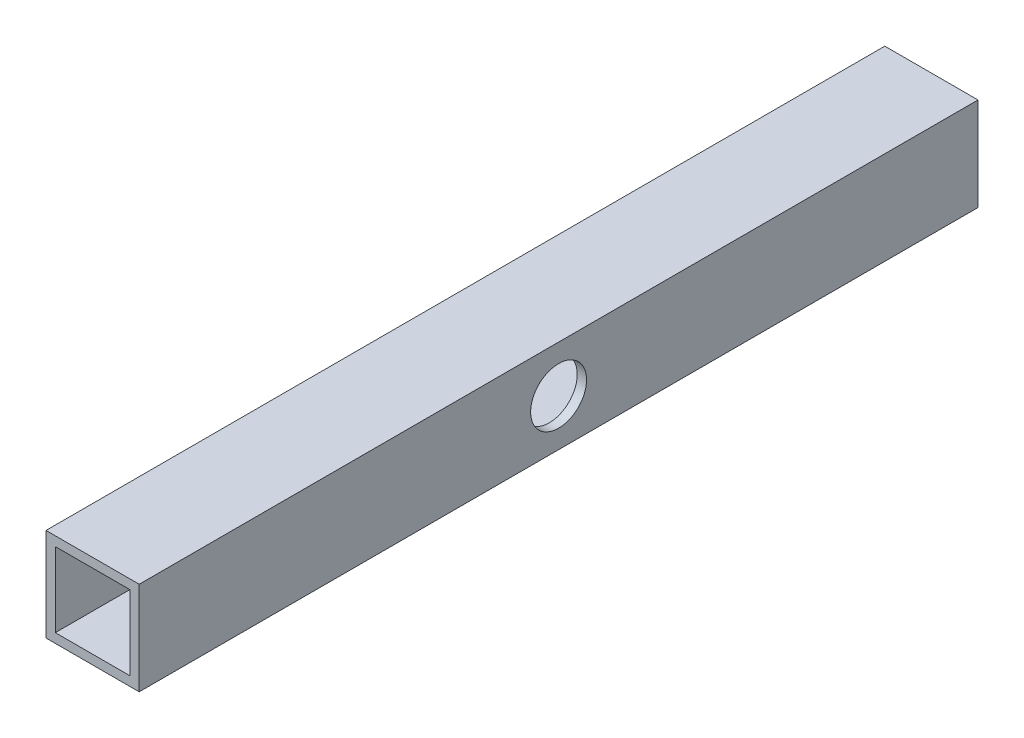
ISO-10303-21;
HEADER;
FILE_DESCRIPTION(('STEP AP214'),'2;1');
FILE_NAME('part.step','',(''),(''),'','','');
FILE_SCHEMA(('AUTOMOTIVE_DESIGN { 1 0 10303 214 1 1 1 1 }'));
ENDSEC;
DATA;
#1=APPLICATION_CONTEXT('core data for automotive mechanical design processes');
#2=APPLICATION_PROTOCOL_DEFINITION('international standard','automotive_design',2000,#1);
#3=PRODUCT_CONTEXT('',#1,'mechanical');
#4=PRODUCT('Part','Part','',(#3));
#5=PRODUCT_RELATED_PRODUCT_CATEGORY('part','',(#4));
#6=PRODUCT_DEFINITION_FORMATION('','',#4);
#7=PRODUCT_DEFINITION_CONTEXT('part definition',#1,'design');
#8=PRODUCT_DEFINITION('design','',#6,#7);
#9=PRODUCT_DEFINITION_SHAPE('','',#8);
#10=(LENGTH_UNIT() NAMED_UNIT(*) SI_UNIT(.MILLI.,.METRE.));
#11=(NAMED_UNIT(*) PLANE_ANGLE_UNIT() SI_UNIT($,.RADIAN.));
#12=(NAMED_UNIT(*) SI_UNIT($,.STERADIAN.) SOLID_ANGLE_UNIT());
#13=UNCERTAINTY_MEASURE_WITH_UNIT(LENGTH_MEASURE(1.E-05),#10,'distance_accuracy_value','');
#14=(GEOMETRIC_REPRESENTATION_CONTEXT(3) GLOBAL_UNCERTAINTY_ASSIGNED_CONTEXT((#13)) GLOBAL_UNIT_ASSIGNED_CONTEXT((#10,
#11,#12)) REPRESENTATION_CONTEXT('',''));
#15=CARTESIAN_POINT('',(0.,0.,0.));
#16=DIRECTION('',(0.,0.,1.));
#17=DIRECTION('',(1.,0.,0.));
#18=AXIS2_PLACEMENT_3D('',#15,#16,#17);
#19=CARTESIAN_POINT('',(0.,0.,450.));
#20=DIRECTION('',(0.,0.,1.));
#21=DIRECTION('',(1.,0.,0.));
#22=AXIS2_PLACEMENT_3D('',#19,#20,#21);
#23=PLANE('',#22);
#24=DIRECTION('',(0.,1.,0.));
#25=VECTOR('',#24,1.);
#26=CARTESIAN_POINT('',(0.,0.,450.));
#27=LINE('',#26,#25);
#28=CARTESIAN_POINT('',(0.,0.,450.));
#29=VERTEX_POINT('',#28);
#30=CARTESIAN_POINT('',(0.,50.,450.));
#31=VERTEX_POINT('',#30);
#32=EDGE_CURVE('E139',#29,#31,#27,.T.);
#33=ORIENTED_EDGE('',*,*,#32,.T.);
#34=DIRECTION('',(-1.,0.,0.));
#35=VECTOR('',#34,1.);
#36=CARTESIAN_POINT('',(0.,50.,450.));
#37=LINE('',#36,#35);
#38=CARTESIAN_POINT('',(-50.,50.,450.));
#39=VERTEX_POINT('',#38);
#40=EDGE_CURVE('E142',#31,#39,#37,.T.);
#41=ORIENTED_EDGE('',*,*,#40,.T.);
#42=DIRECTION('',(0.,-1.,0.));
#43=VECTOR('',#42,1.);
#44=CARTESIAN_POINT('',(-50.,0.,450.));
#45=LINE('',#44,#43);
#46=CARTESIAN_POINT('',(-50.,0.,450.));
#47=VERTEX_POINT('',#46);
#48=EDGE_CURVE('E145',#39,#47,#45,.T.);
#49=ORIENTED_EDGE('',*,*,#48,.T.);
#50=DIRECTION('',(1.,0.,0.));
#51=VECTOR('',#50,1.);
#52=CARTESIAN_POINT('',(0.,0.,450.));
#53=LINE('',#52,#51);
#54=EDGE_CURVE('E147',#47,#29,#53,.T.);
#55=ORIENTED_EDGE('',*,*,#54,.T.);
#56=EDGE_LOOP('',(#33,#41,#49,#55));
#57=FACE_BOUND('',#56,.T.);
#58=DIRECTION('',(-1.,0.,0.));
#59=VECTOR('',#58,1.);
#60=CARTESIAN_POINT('',(-5.,45.,450.));
#61=LINE('',#60,#59);
#62=CARTESIAN_POINT('',(-5.,45.,450.));
#63=VERTEX_POINT('',#62);
#64=CARTESIAN_POINT('',(-45.,45.,450.));
#65=VERTEX_POINT('',#64);
#66=EDGE_CURVE('E109',#63,#65,#61,.T.);
#67=ORIENTED_EDGE('',*,*,#66,.F.);
#68=DIRECTION('',(0.,1.,0.));
#69=VECTOR('',#68,1.);
#70=CARTESIAN_POINT('',(-5.,5.,450.));
#71=LINE('',#70,#69);
#72=CARTESIAN_POINT('',(-5.,5.,450.));
#73=VERTEX_POINT('',#72);
#74=EDGE_CURVE('E101',#73,#63,#71,.T.);
#75=ORIENTED_EDGE('',*,*,#74,.F.);
#76=DIRECTION('',(1.,0.,0.));
#77=VECTOR('',#76,1.);
#78=CARTESIAN_POINT('',(-5.,5.,450.));
#79=LINE('',#78,#77);
#80=CARTESIAN_POINT('',(-45.,5.,450.));
#81=VERTEX_POINT('',#80);
#82=EDGE_CURVE('E123',#81,#73,#79,.T.);
#83=ORIENTED_EDGE('',*,*,#82,.F.);
#84=DIRECTION('',(0.,-1.,0.));
#85=VECTOR('',#84,1.);
#86=CARTESIAN_POINT('',(-45.,5.,450.));
#87=LINE('',#86,#85);
#88=EDGE_CURVE('E121',#65,#81,#87,.T.);
#89=ORIENTED_EDGE('',*,*,#88,.F.);
#90=EDGE_LOOP('',(#67,#75,#83,#89));
#91=FACE_BOUND('',#90,.T.);
#92=ADVANCED_FACE('F35',(#57,#91),#23,.T.);
#93=CARTESIAN_POINT('',(0.,0.,0.));
#94=DIRECTION('',(0.,0.,1.));
#95=DIRECTION('',(1.,0.,0.));
#96=AXIS2_PLACEMENT_3D('',#93,#94,#95);
#97=PLANE('',#96);
#98=DIRECTION('',(0.,1.,0.));
#99=VECTOR('',#98,1.);
#100=CARTESIAN_POINT('',(0.,0.,0.));
#101=LINE('',#100,#99);
#102=CARTESIAN_POINT('',(0.,0.,0.));
#103=VERTEX_POINT('',#102);
#104=CARTESIAN_POINT('',(0.,50.,0.));
#105=VERTEX_POINT('',#104);
#106=EDGE_CURVE('E117',#103,#105,#101,.T.);
#107=ORIENTED_EDGE('',*,*,#106,.F.);
#108=DIRECTION('',(1.,0.,0.));
#109=VECTOR('',#108,1.);
#110=CARTESIAN_POINT('',(0.,0.,0.));
#111=LINE('',#110,#109);
#112=CARTESIAN_POINT('',(-50.,0.,0.));
#113=VERTEX_POINT('',#112);
#114=EDGE_CURVE('E143',#113,#103,#111,.T.);
#115=ORIENTED_EDGE('',*,*,#114,.F.);
#116=DIRECTION('',(0.,-1.,0.));
#117=VECTOR('',#116,1.);
#118=CARTESIAN_POINT('',(-50.,0.,0.));
#119=LINE('',#118,#117);
#120=CARTESIAN_POINT('',(-50.,50.,0.));
#121=VERTEX_POINT('',#120);
#122=EDGE_CURVE('E154',#121,#113,#119,.T.);
#123=ORIENTED_EDGE('',*,*,#122,.F.);
#124=DIRECTION('',(-1.,0.,0.));
#125=VECTOR('',#124,1.);
#126=CARTESIAN_POINT('',(0.,50.,0.));
#127=LINE('',#126,#125);
#128=EDGE_CURVE('E152',#105,#121,#127,.T.);
#129=ORIENTED_EDGE('',*,*,#128,.F.);
#130=EDGE_LOOP('',(#107,#115,#123,#129));
#131=FACE_BOUND('',#130,.T.);
#132=DIRECTION('',(0.,1.,0.));
#133=VECTOR('',#132,1.);
#134=CARTESIAN_POINT('',(-5.,5.,0.));
#135=LINE('',#134,#133);
#136=CARTESIAN_POINT('',(-5.,5.,0.));
#137=VERTEX_POINT('',#136);
#138=CARTESIAN_POINT('',(-5.,45.,0.));
#139=VERTEX_POINT('',#138);
#140=EDGE_CURVE('E59',#137,#139,#135,.T.);
#141=ORIENTED_EDGE('',*,*,#140,.T.);
#142=DIRECTION('',(-1.,0.,0.));
#143=VECTOR('',#142,1.);
#144=CARTESIAN_POINT('',(-5.,45.,0.));
#145=LINE('',#144,#143);
#146=CARTESIAN_POINT('',(-45.,45.,0.));
#147=VERTEX_POINT('',#146);
#148=EDGE_CURVE('E116',#139,#147,#145,.T.);
#149=ORIENTED_EDGE('',*,*,#148,.T.);
#150=DIRECTION('',(0.,-1.,0.));
#151=VECTOR('',#150,1.);
#152=CARTESIAN_POINT('',(-45.,5.,0.));
#153=LINE('',#152,#151);
#154=CARTESIAN_POINT('',(-45.,5.,0.));
#155=VERTEX_POINT('',#154);
#156=EDGE_CURVE('E131',#147,#155,#153,.T.);
#157=ORIENTED_EDGE('',*,*,#156,.T.);
#158=DIRECTION('',(1.,0.,0.));
#159=VECTOR('',#158,1.);
#160=CARTESIAN_POINT('',(-5.,5.,0.));
#161=LINE('',#160,#159);
#162=EDGE_CURVE('E110',#155,#137,#161,.T.);
#163=ORIENTED_EDGE('',*,*,#162,.T.);
#164=EDGE_LOOP('',(#141,#149,#157,#163));
#165=FACE_BOUND('',#164,.T.);
#166=ADVANCED_FACE('F173',(#131,#165),#97,.F.);
#167=CARTESIAN_POINT('',(0.,0.,450.));
#168=DIRECTION('',(-1.,0.,0.));
#169=DIRECTION('',(0.,0.,1.));
#170=AXIS2_PLACEMENT_3D('',#167,#168,#169);
#171=PLANE('',#170);
#172=CARTESIAN_POINT('',(0.,25.,225.));
#173=DIRECTION('',(1.,0.,0.));
#174=DIRECTION('',(0.,0.,-1.));
#175=AXIS2_PLACEMENT_3D('',#172,#173,#174);
#176=CIRCLE('',#175,15.);
#177=CARTESIAN_POINT('',(0.,25.,210.));
#178=VERTEX_POINT('',#177);
#179=EDGE_CURVE('E217',#178,#178,#176,.T.);
#180=ORIENTED_EDGE('',*,*,#179,.F.);
#181=EDGE_LOOP('',(#180));
#182=FACE_BOUND('',#181,.T.);
#183=ORIENTED_EDGE('',*,*,#106,.T.);
#184=DIRECTION('',(0.,0.,-1.));
#185=VECTOR('',#184,1.);
#186=CARTESIAN_POINT('',(0.,50.,450.));
#187=LINE('',#186,#185);
#188=EDGE_CURVE('E11',#31,#105,#187,.T.);
#189=ORIENTED_EDGE('',*,*,#188,.F.);
#190=ORIENTED_EDGE('',*,*,#32,.F.);
#191=DIRECTION('',(0.,0.,-1.));
#192=VECTOR('',#191,1.);
#193=CARTESIAN_POINT('',(0.,0.,450.));
#194=LINE('',#193,#192);
#195=EDGE_CURVE('E149',#29,#103,#194,.T.);
#196=ORIENTED_EDGE('',*,*,#195,.T.);
#197=EDGE_LOOP('',(#183,#189,#190,#196));
#198=FACE_BOUND('',#197,.T.);
#199=ADVANCED_FACE('F37',(#182,#198),#171,.F.);
#200=CARTESIAN_POINT('',(0.,50.,450.));
#201=DIRECTION('',(0.,-1.,0.));
#202=DIRECTION('',(1.,0.,0.));
#203=AXIS2_PLACEMENT_3D('',#200,#201,#202);
#204=PLANE('',#203);
#205=ORIENTED_EDGE('',*,*,#128,.T.);
#206=DIRECTION('',(0.,0.,-1.));
#207=VECTOR('',#206,1.);
#208=CARTESIAN_POINT('',(-50.,50.,450.));
#209=LINE('',#208,#207);
#210=EDGE_CURVE('E44',#39,#121,#209,.T.);
#211=ORIENTED_EDGE('',*,*,#210,.F.);
#212=ORIENTED_EDGE('',*,*,#40,.F.);
#213=ORIENTED_EDGE('',*,*,#188,.T.);
#214=EDGE_LOOP('',(#205,#211,#212,#213));
#215=FACE_BOUND('',#214,.T.);
#216=ADVANCED_FACE('F183',(#215),#204,.F.);
#217=CARTESIAN_POINT('',(-50.,0.,450.));
#218=DIRECTION('',(1.,0.,0.));
#219=DIRECTION('',(0.,0.,-1.));
#220=AXIS2_PLACEMENT_3D('',#217,#218,#219);
#221=PLANE('',#220);
#222=CARTESIAN_POINT('',(-50.,25.,225.));
#223=DIRECTION('',(1.,0.,0.));
#224=DIRECTION('',(0.,0.,-1.));
#225=AXIS2_PLACEMENT_3D('',#222,#223,#224);
#226=CIRCLE('',#225,15.);
#227=CARTESIAN_POINT('',(-50.,25.,210.));
#228=VERTEX_POINT('',#227);
#229=EDGE_CURVE('E129',#228,#228,#226,.T.);
#230=ORIENTED_EDGE('',*,*,#229,.T.);
#231=EDGE_LOOP('',(#230));
#232=FACE_BOUND('',#231,.T.);
#233=ORIENTED_EDGE('',*,*,#122,.T.);
#234=DIRECTION('',(0.,0.,-1.));
#235=VECTOR('',#234,1.);
#236=CARTESIAN_POINT('',(-50.,0.,450.));
#237=LINE('',#236,#235);
#238=EDGE_CURVE('E159',#47,#113,#237,.T.);
#239=ORIENTED_EDGE('',*,*,#238,.F.);
#240=ORIENTED_EDGE('',*,*,#48,.F.);
#241=ORIENTED_EDGE('',*,*,#210,.T.);
#242=EDGE_LOOP('',(#233,#239,#240,#241));
#243=FACE_BOUND('',#242,.T.);
#244=ADVANCED_FACE('F167',(#232,#243),#221,.F.);
#245=CARTESIAN_POINT('',(0.,0.,450.));
#246=DIRECTION('',(0.,1.,0.));
#247=DIRECTION('',(-1.,0.,0.));
#248=AXIS2_PLACEMENT_3D('',#245,#246,#247);
#249=PLANE('',#248);
#250=ORIENTED_EDGE('',*,*,#114,.T.);
#251=ORIENTED_EDGE('',*,*,#195,.F.);
#252=ORIENTED_EDGE('',*,*,#54,.F.);
#253=ORIENTED_EDGE('',*,*,#238,.T.);
#254=EDGE_LOOP('',(#250,#251,#252,#253));
#255=FACE_BOUND('',#254,.T.);
#256=ADVANCED_FACE('F177',(#255),#249,.F.);
#257=CARTESIAN_POINT('',(-5.,5.,450.));
#258=DIRECTION('',(-1.,0.,0.));
#259=DIRECTION('',(0.,-1.,0.));
#260=AXIS2_PLACEMENT_3D('',#257,#258,#259);
#261=PLANE('',#260);
#262=CARTESIAN_POINT('',(-5.,25.,225.));
#263=DIRECTION('',(-1.,0.,0.));
#264=DIRECTION('',(0.,-1.,0.));
#265=AXIS2_PLACEMENT_3D('',#262,#263,#264);
#266=CIRCLE('',#265,15.);
#267=CARTESIAN_POINT('',(-5.00000000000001,10.,225.));
#268=VERTEX_POINT('',#267);
#269=EDGE_CURVE('E212',#268,#268,#266,.T.);
#270=ORIENTED_EDGE('',*,*,#269,.F.);
#271=EDGE_LOOP('',(#270));
#272=FACE_BOUND('',#271,.T.);
#273=ORIENTED_EDGE('',*,*,#140,.F.);
#274=DIRECTION('',(0.,0.,-1.));
#275=VECTOR('',#274,1.);
#276=CARTESIAN_POINT('',(-5.,5.,450.));
#277=LINE('',#276,#275);
#278=EDGE_CURVE('E105',#73,#137,#277,.T.);
#279=ORIENTED_EDGE('',*,*,#278,.F.);
#280=ORIENTED_EDGE('',*,*,#74,.T.);
#281=DIRECTION('',(0.,0.,-1.));
#282=VECTOR('',#281,1.);
#283=CARTESIAN_POINT('',(-5.,45.,450.));
#284=LINE('',#283,#282);
#285=EDGE_CURVE('E104',#63,#139,#284,.T.);
#286=ORIENTED_EDGE('',*,*,#285,.T.);
#287=EDGE_LOOP('',(#273,#279,#280,#286));
#288=FACE_BOUND('',#287,.T.);
#289=ADVANCED_FACE('F103',(#272,#288),#261,.T.);
#290=CARTESIAN_POINT('',(-5.,45.,450.));
#291=DIRECTION('',(0.,-1.,0.));
#292=DIRECTION('',(1.,0.,0.));
#293=AXIS2_PLACEMENT_3D('',#290,#291,#292);
#294=PLANE('',#293);
#295=ORIENTED_EDGE('',*,*,#148,.F.);
#296=ORIENTED_EDGE('',*,*,#285,.F.);
#297=ORIENTED_EDGE('',*,*,#66,.T.);
#298=DIRECTION('',(0.,0.,-1.));
#299=VECTOR('',#298,1.);
#300=CARTESIAN_POINT('',(-45.,45.,450.));
#301=LINE('',#300,#299);
#302=EDGE_CURVE('E118',#65,#147,#301,.T.);
#303=ORIENTED_EDGE('',*,*,#302,.T.);
#304=EDGE_LOOP('',(#295,#296,#297,#303));
#305=FACE_BOUND('',#304,.T.);
#306=ADVANCED_FACE('F113',(#305),#294,.T.);
#307=CARTESIAN_POINT('',(-45.,5.,450.));
#308=DIRECTION('',(1.,0.,0.));
#309=DIRECTION('',(0.,0.,-1.));
#310=AXIS2_PLACEMENT_3D('',#307,#308,#309);
#311=PLANE('',#310);
#312=CARTESIAN_POINT('',(-45.,25.,225.));
#313=DIRECTION('',(1.,0.,0.));
#314=DIRECTION('',(0.,0.,-1.));
#315=AXIS2_PLACEMENT_3D('',#312,#313,#314);
#316=CIRCLE('',#315,15.);
#317=CARTESIAN_POINT('',(-45.,25.,210.));
#318=VERTEX_POINT('',#317);
#319=EDGE_CURVE('E39',#318,#318,#316,.T.);
#320=ORIENTED_EDGE('',*,*,#319,.F.);
#321=EDGE_LOOP('',(#320));
#322=FACE_BOUND('',#321,.T.);
#323=ORIENTED_EDGE('',*,*,#156,.F.);
#324=ORIENTED_EDGE('',*,*,#302,.F.);
#325=ORIENTED_EDGE('',*,*,#88,.T.);
#326=DIRECTION('',(0.,0.,-1.));
#327=VECTOR('',#326,1.);
#328=CARTESIAN_POINT('',(-45.,5.,450.));
#329=LINE('',#328,#327);
#330=EDGE_CURVE('E51',#81,#155,#329,.T.);
#331=ORIENTED_EDGE('',*,*,#330,.T.);
#332=EDGE_LOOP('',(#323,#324,#325,#331));
#333=FACE_BOUND('',#332,.T.);
#334=ADVANCED_FACE('F209',(#322,#333),#311,.T.);
#335=CARTESIAN_POINT('',(-5.,5.,450.));
#336=DIRECTION('',(0.,1.,0.));
#337=DIRECTION('',(0.,0.,1.));
#338=AXIS2_PLACEMENT_3D('',#335,#336,#337);
#339=PLANE('',#338);
#340=ORIENTED_EDGE('',*,*,#162,.F.);
#341=ORIENTED_EDGE('',*,*,#330,.F.);
#342=ORIENTED_EDGE('',*,*,#82,.T.);
#343=ORIENTED_EDGE('',*,*,#278,.T.);
#344=EDGE_LOOP('',(#340,#341,#342,#343));
#345=FACE_BOUND('',#344,.T.);
#346=ADVANCED_FACE('F229',(#345),#339,.T.);
#347=CARTESIAN_POINT('',(-79.,25.,225.));
#348=DIRECTION('',(1.,0.,0.));
#349=DIRECTION('',(0.,0.,-1.));
#350=AXIS2_PLACEMENT_3D('',#347,#348,#349);
#351=CYLINDRICAL_SURFACE('',#350,15.);
#352=ORIENTED_EDGE('',*,*,#319,.T.);
#353=EDGE_LOOP('',(#352));
#354=FACE_BOUND('',#353,.T.);
#355=ORIENTED_EDGE('',*,*,#229,.F.);
#356=EDGE_LOOP('',(#355));
#357=FACE_BOUND('',#356,.T.);
#358=ADVANCED_FACE('F224',(#354,#357),#351,.F.);
#359=ORIENTED_EDGE('',*,*,#269,.T.);
#360=EDGE_LOOP('',(#359));
#361=FACE_BOUND('',#360,.T.);
#362=ORIENTED_EDGE('',*,*,#179,.T.);
#363=EDGE_LOOP('',(#362));
#364=FACE_BOUND('',#363,.T.);
#365=ADVANCED_FACE('F222',(#361,#364),#351,.F.);
#366=CLOSED_SHELL('',(#92,#166,#199,#216,#244,#256,#289,#306,#334,#346,#358,#365));
#367=MANIFOLD_SOLID_BREP('B2',#366);
#368=ADVANCED_BREP_SHAPE_REPRESENTATION('',(#18,#367),#14);
#369=SHAPE_DEFINITION_REPRESENTATION(#9,#368);
ENDSEC;
END-ISO-10303-21;
